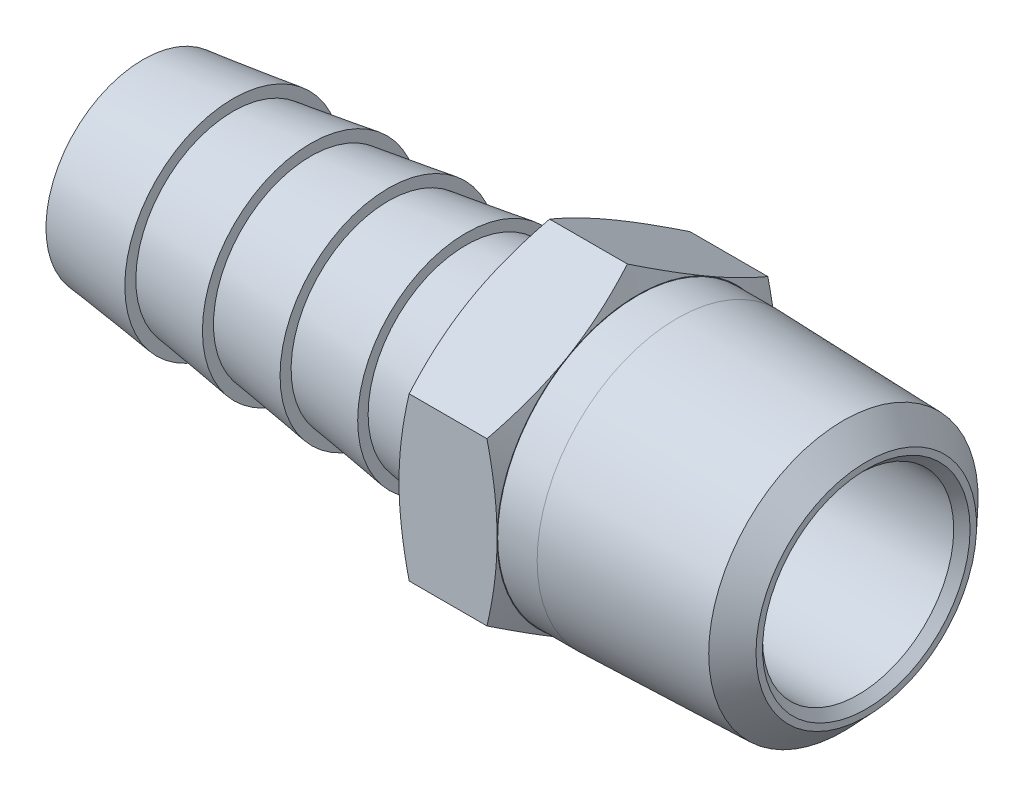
ISO-10303-21;
HEADER;
FILE_DESCRIPTION(('STEP AP214'),'2;1');
FILE_NAME('part.step','',(''),(''),'','','');
FILE_SCHEMA(('AUTOMOTIVE_DESIGN { 1 0 10303 214 1 1 1 1 }'));
ENDSEC;
DATA;
#1=APPLICATION_CONTEXT('core data for automotive mechanical design processes');
#2=APPLICATION_PROTOCOL_DEFINITION('international standard','automotive_design',2000,#1);
#3=PRODUCT_CONTEXT('',#1,'mechanical');
#4=PRODUCT('Part','Part','',(#3));
#5=PRODUCT_RELATED_PRODUCT_CATEGORY('part','',(#4));
#6=PRODUCT_DEFINITION_FORMATION('','',#4);
#7=PRODUCT_DEFINITION_CONTEXT('part definition',#1,'design');
#8=PRODUCT_DEFINITION('design','',#6,#7);
#9=PRODUCT_DEFINITION_SHAPE('','',#8);
#10=(LENGTH_UNIT() NAMED_UNIT(*) SI_UNIT(.MILLI.,.METRE.));
#11=(NAMED_UNIT(*) PLANE_ANGLE_UNIT() SI_UNIT($,.RADIAN.));
#12=(NAMED_UNIT(*) SI_UNIT($,.STERADIAN.) SOLID_ANGLE_UNIT());
#13=UNCERTAINTY_MEASURE_WITH_UNIT(LENGTH_MEASURE(1.E-05),#10,'distance_accuracy_value','');
#14=(GEOMETRIC_REPRESENTATION_CONTEXT(3) GLOBAL_UNCERTAINTY_ASSIGNED_CONTEXT((#13)) GLOBAL_UNIT_ASSIGNED_CONTEXT((#10,
#11,#12)) REPRESENTATION_CONTEXT('',''));
#15=CARTESIAN_POINT('',(0.,0.,0.));
#16=DIRECTION('',(0.,0.,1.));
#17=DIRECTION('',(1.,0.,0.));
#18=AXIS2_PLACEMENT_3D('',#15,#16,#17);
#19=CARTESIAN_POINT('',(24.638,0.,0.));
#20=DIRECTION('',(1.,0.,0.));
#21=DIRECTION('',(0.,0.,-1.));
#22=AXIS2_PLACEMENT_3D('',#19,#20,#21);
#23=PLANE('',#22);
#24=CARTESIAN_POINT('',(24.6380000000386,0.,0.));
#25=DIRECTION('',(1.,0.,0.));
#26=DIRECTION('',(0.,0.,-1.));
#27=AXIS2_PLACEMENT_3D('',#24,#25,#26);
#28=CIRCLE('',#27,6.73099999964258);
#29=CARTESIAN_POINT('',(24.6380000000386,0.,-6.73099999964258));
#30=VERTEX_POINT('',#29);
#31=EDGE_CURVE('E110',#30,#30,#28,.F.);
#32=ORIENTED_EDGE('',*,*,#31,.F.);
#33=EDGE_LOOP('',(#32));
#34=FACE_BOUND('',#33,.T.);
#35=CARTESIAN_POINT('',(24.6379999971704,0.,0.));
#36=DIRECTION('',(1.,0.,0.));
#37=DIRECTION('',(0.,1.,0.));
#38=AXIS2_PLACEMENT_3D('',#35,#36,#37);
#39=CIRCLE('',#38,8.73125000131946);
#40=CARTESIAN_POINT('',(24.6379999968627,-7.56148430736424,4.36562500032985));
#41=VERTEX_POINT('',#40);
#42=CARTESIAN_POINT('',(24.6379999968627,-7.56148430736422,-4.36562500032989));
#43=VERTEX_POINT('',#42);
#44=EDGE_CURVE('E111',#41,#43,#39,.T.);
#45=ORIENTED_EDGE('',*,*,#44,.F.);
#46=CARTESIAN_POINT('',(24.6379999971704,0.,0.));
#47=DIRECTION('',(1.,0.,0.));
#48=DIRECTION('',(0.,1.,0.));
#49=AXIS2_PLACEMENT_3D('',#46,#47,#48);
#50=CIRCLE('',#49,8.73125000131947);
#51=CARTESIAN_POINT('',(24.6379999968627,0.,8.73125000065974));
#52=VERTEX_POINT('',#51);
#53=EDGE_CURVE('E529',#52,#41,#50,.T.);
#54=ORIENTED_EDGE('',*,*,#53,.F.);
#55=CARTESIAN_POINT('',(24.6379999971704,0.,0.));
#56=DIRECTION('',(1.,0.,0.));
#57=DIRECTION('',(0.,1.,0.));
#58=AXIS2_PLACEMENT_3D('',#55,#56,#57);
#59=CIRCLE('',#58,8.73125000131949);
#60=CARTESIAN_POINT('',(24.6379999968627,7.56148430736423,4.36562500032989));
#61=VERTEX_POINT('',#60);
#62=EDGE_CURVE('E531',#61,#52,#59,.T.);
#63=ORIENTED_EDGE('',*,*,#62,.F.);
#64=CARTESIAN_POINT('',(24.6379999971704,0.,0.));
#65=DIRECTION('',(1.,0.,0.));
#66=DIRECTION('',(0.,1.,0.));
#67=AXIS2_PLACEMENT_3D('',#64,#65,#66);
#68=CIRCLE('',#67,8.73125000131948);
#69=CARTESIAN_POINT('',(24.6379999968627,7.56148430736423,-4.36562500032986));
#70=VERTEX_POINT('',#69);
#71=EDGE_CURVE('E124',#70,#61,#68,.T.);
#72=ORIENTED_EDGE('',*,*,#71,.F.);
#73=CARTESIAN_POINT('',(24.6379999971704,0.,0.));
#74=DIRECTION('',(1.,0.,0.));
#75=DIRECTION('',(0.,1.,0.));
#76=AXIS2_PLACEMENT_3D('',#73,#74,#75);
#77=CIRCLE('',#76,8.73125000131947);
#78=CARTESIAN_POINT('',(24.6379999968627,0.,-8.73125000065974));
#79=VERTEX_POINT('',#78);
#80=EDGE_CURVE('E18',#79,#70,#77,.T.);
#81=ORIENTED_EDGE('',*,*,#80,.F.);
#82=CARTESIAN_POINT('',(24.6379999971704,0.,0.));
#83=DIRECTION('',(1.,0.,0.));
#84=DIRECTION('',(0.,1.,0.));
#85=AXIS2_PLACEMENT_3D('',#82,#83,#84);
#86=CIRCLE('',#85,8.73125000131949);
#87=EDGE_CURVE('E101',#43,#79,#86,.T.);
#88=ORIENTED_EDGE('',*,*,#87,.F.);
#89=EDGE_LOOP('',(#45,#54,#63,#72,#81,#88));
#90=FACE_BOUND('',#89,.T.);
#91=ADVANCED_FACE('F14',(#34,#90),#23,.F.);
#92=CARTESIAN_POINT('',(25.2716344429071,0.,0.));
#93=DIRECTION('',(1.,0.,0.));
#94=DIRECTION('',(0.,1.,0.));
#95=AXIS2_PLACEMENT_3D('',#92,#93,#94);
#96=CONICAL_SURFACE('',#95,10.0900834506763,1.1344640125);
#97=CARTESIAN_POINT('',(24.6379999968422,0.,-8.73124999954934));
#98=CARTESIAN_POINT('',(24.6379747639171,0.21260870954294,-8.73124999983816));
#99=CARTESIAN_POINT('',(24.6416206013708,0.425211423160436,-8.73124999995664));
#100=CARTESIAN_POINT('',(24.6560676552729,0.850150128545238,-8.73125000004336));
#101=CARTESIAN_POINT('',(24.6668680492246,1.0624861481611,-8.73125000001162));
#102=CARTESIAN_POINT('',(24.6953900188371,1.4859802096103,-8.73124999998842));
#103=CARTESIAN_POINT('',(24.7130884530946,1.69713982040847,-8.73124999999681));
#104=CARTESIAN_POINT('',(24.7550637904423,2.11880198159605,-8.73125000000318));
#105=CARTESIAN_POINT('',(24.7793407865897,2.32930452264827,-8.73125000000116));
#106=CARTESIAN_POINT('',(24.8613831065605,2.95925193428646,-8.73124999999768));
#107=CARTESIAN_POINT('',(24.9283852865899,3.37749625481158,-8.73124999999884));
#108=CARTESIAN_POINT('',(25.0833534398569,4.21157495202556,-8.73125000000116));
#109=CARTESIAN_POINT('',(25.1713893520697,4.62739644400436,-8.73125000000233));
#110=CARTESIAN_POINT('',(25.2678553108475,5.04098953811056,-8.73125));
#111=B_SPLINE_CURVE_WITH_KNOTS('',3,(#97,#98,#99,#100,#101,#102,#103,#104,#105,#106,#107,#108,
#109,#110),.UNSPECIFIED.,.F.,.F.,(4,2,2,2,2,2,4),(0.,0.637785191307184,1.27549707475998,
1.9110877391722,2.54668739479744,3.81680689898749,5.0912099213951),.UNSPECIFIED.);
#112=CARTESIAN_POINT('',(25.2678553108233,5.04098953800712,-8.73125));
#113=VERTEX_POINT('',#112);
#114=EDGE_CURVE('E116',#79,#113,#111,.T.);
#115=ORIENTED_EDGE('',*,*,#114,.F.);
#116=ORIENTED_EDGE('',*,*,#80,.T.);
#117=CARTESIAN_POINT('',(25.2678553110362,5.04098953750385,-8.73125000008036));
#118=CARTESIAN_POINT('',(25.1713893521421,5.24778608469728,-8.37306787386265));
#119=CARTESIAN_POINT('',(25.0833534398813,5.45569683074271,-8.01295589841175));
#120=CARTESIAN_POINT('',(24.9283852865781,5.87273617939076,-7.29062255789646));
#121=CARTESIAN_POINT('',(24.8613831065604,6.08185833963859,-6.92841235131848));
#122=CARTESIAN_POINT('',(24.7793407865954,6.39683204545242,-6.38286188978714));
#123=CARTESIAN_POINT('',(24.7550637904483,6.50208331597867,-6.2005613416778));
#124=CARTESIAN_POINT('',(24.7130884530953,6.71291439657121,-5.8353911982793));
#125=CARTESIAN_POINT('',(24.6953900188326,6.81849420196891,-5.65252161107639));
#126=CARTESIAN_POINT('',(24.6668680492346,7.03024123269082,-5.28576499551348));
#127=CARTESIAN_POINT('',(24.6560676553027,7.13640924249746,-5.1018766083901));
#128=CARTESIAN_POINT('',(24.6416206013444,7.34887859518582,-4.73386889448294));
#129=CARTESIAN_POINT('',(24.6379747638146,7.45517995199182,-4.54974954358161));
#130=CARTESIAN_POINT('',(24.6379999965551,7.56148430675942,-4.36562500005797));
#131=B_SPLINE_CURVE_WITH_KNOTS('',3,(#117,#118,#119,#120,#121,#122,#123,#124,#125,#126,#127,
#128,#129,#130),.UNSPECIFIED.,.F.,.F.,(4,2,2,2,2,2,4),(0.,1.27440302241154,2.54452252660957,
3.18012218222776,3.81571284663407,4.45342473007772,5.09120992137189),.UNSPECIFIED.);
#132=EDGE_CURVE('E130',#113,#70,#131,.T.);
#133=ORIENTED_EDGE('',*,*,#132,.F.);
#134=EDGE_LOOP('',(#115,#116,#133));
#135=FACE_BOUND('',#134,.T.);
#136=ADVANCED_FACE('F129',(#135),#96,.T.);
#137=CARTESIAN_POINT('',(25.2716344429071,0.,0.));
#138=DIRECTION('',(1.,0.,0.));
#139=DIRECTION('',(0.,1.,0.));
#140=AXIS2_PLACEMENT_3D('',#137,#138,#139);
#141=CONICAL_SURFACE('',#140,10.0900834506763,1.1344640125);
#142=CARTESIAN_POINT('',(24.6379999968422,7.5614843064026,-4.36562499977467));
#143=CARTESIAN_POINT('',(24.6379747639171,7.66778866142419,-4.18150045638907));
#144=CARTESIAN_POINT('',(24.6416206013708,7.77409001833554,-3.99738110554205));
#145=CARTESIAN_POINT('',(24.6560676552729,7.98655937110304,-3.6293733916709));
#146=CARTESIAN_POINT('',(24.6668680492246,8.09272738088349,-3.44548500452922));
#147=CARTESIAN_POINT('',(24.6953900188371,8.304474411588,-3.07872838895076));
#148=CARTESIAN_POINT('',(24.7130884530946,8.41005421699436,-2.89585880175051));
#149=CARTESIAN_POINT('',(24.7550637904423,8.62088529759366,-2.5306886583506));
#150=CARTESIAN_POINT('',(24.7793407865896,8.72613656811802,-2.34838811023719));
#151=CARTESIAN_POINT('',(24.8613831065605,9.0411102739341,-1.80283764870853));
#152=CARTESIAN_POINT('',(24.9283852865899,9.25023243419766,-1.44062744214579));
#153=CARTESIAN_POINT('',(25.0833534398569,9.66727178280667,-0.718294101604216));
#154=CARTESIAN_POINT('',(25.1713893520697,9.87518252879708,-0.35818212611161));
#155=CARTESIAN_POINT('',(25.2678553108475,10.0819790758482,2.15330518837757E-10));
#156=B_SPLINE_CURVE_WITH_KNOTS('',3,(#142,#143,#144,#145,#146,#147,#148,#149,#150,#151,#152,
#153,#154,#155),.UNSPECIFIED.,.F.,.F.,(4,2,2,2,2,2,4),(0.,0.637785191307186,1.27549707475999,
1.91108773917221,2.54668739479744,3.8168068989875,5.09120992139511),.UNSPECIFIED.);
#157=CARTESIAN_POINT('',(25.2678553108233,10.0819790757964,1.25751281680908E-10));
#158=VERTEX_POINT('',#157);
#159=EDGE_CURVE('E493',#70,#158,#156,.T.);
#160=ORIENTED_EDGE('',*,*,#159,.F.);
#161=ORIENTED_EDGE('',*,*,#71,.T.);
#162=CARTESIAN_POINT('',(25.2678553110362,10.0819790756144,-3.5028064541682E-10));
#163=CARTESIAN_POINT('',(25.1713893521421,9.87518252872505,0.358182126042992));
#164=CARTESIAN_POINT('',(25.0833534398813,9.6672717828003,0.718294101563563));
#165=CARTESIAN_POINT('',(24.9283852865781,9.25023243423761,1.44062744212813));
#166=CARTESIAN_POINT('',(24.8613831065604,9.04111027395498,1.80283764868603));
#167=CARTESIAN_POINT('',(24.7793407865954,8.72613656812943,2.3483881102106));
#168=CARTESIAN_POINT('',(24.7550637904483,8.62088529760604,2.5306886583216));
#169=CARTESIAN_POINT('',(24.7130884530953,8.4100542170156,2.89585880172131));
#170=CARTESIAN_POINT('',(24.6953900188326,8.30447441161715,3.07872838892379));
#171=CARTESIAN_POINT('',(24.6668680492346,8.09272738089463,3.44548500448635));
#172=CARTESIAN_POINT('',(24.6560676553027,7.98655937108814,3.62937339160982));
#173=CARTESIAN_POINT('',(24.6416206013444,7.77409001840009,3.99738110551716));
#174=CARTESIAN_POINT('',(24.6379747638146,7.66778866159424,4.18150045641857));
#175=CARTESIAN_POINT('',(24.6379999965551,7.56148430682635,4.36562499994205));
#176=B_SPLINE_CURVE_WITH_KNOTS('',3,(#162,#163,#164,#165,#166,#167,#168,#169,#170,#171,#172,
#173,#174,#175),.UNSPECIFIED.,.F.,.F.,(4,2,2,2,2,2,4),(0.,1.27440302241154,2.54452252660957,
3.18012218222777,3.81571284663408,4.45342473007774,5.09120992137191),.UNSPECIFIED.);
#177=EDGE_CURVE('E332',#158,#61,#176,.T.);
#178=ORIENTED_EDGE('',*,*,#177,.F.);
#179=EDGE_LOOP('',(#160,#161,#178));
#180=FACE_BOUND('',#179,.T.);
#181=ADVANCED_FACE('F156',(#180),#141,.T.);
#182=CARTESIAN_POINT('',(25.2716344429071,0.,0.));
#183=DIRECTION('',(1.,0.,0.));
#184=DIRECTION('',(0.,1.,0.));
#185=AXIS2_PLACEMENT_3D('',#182,#183,#184);
#186=CONICAL_SURFACE('',#185,10.0900834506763,1.1344640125);
#187=CARTESIAN_POINT('',(24.6379999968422,7.5614843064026,4.36562499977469));
#188=CARTESIAN_POINT('',(24.6379747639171,7.45517995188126,4.5497495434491));
#189=CARTESIAN_POINT('',(24.6416206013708,7.34887859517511,4.7338688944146));
#190=CARTESIAN_POINT('',(24.6560676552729,7.13640924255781,5.10187660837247));
#191=CARTESIAN_POINT('',(24.6668680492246,7.03024123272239,5.2857649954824));
#192=CARTESIAN_POINT('',(24.6953900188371,6.8184942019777,5.65252161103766));
#193=CARTESIAN_POINT('',(24.7130884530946,6.71291439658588,5.83539119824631));
#194=CARTESIAN_POINT('',(24.7550637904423,6.50208331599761,6.20056134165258));
#195=CARTESIAN_POINT('',(24.7793407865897,6.39683204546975,6.38286188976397));
#196=CARTESIAN_POINT('',(24.8613831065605,6.08185833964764,6.92841235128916));
#197=CARTESIAN_POINT('',(24.9283852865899,5.87273617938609,7.29062255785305));
#198=CARTESIAN_POINT('',(25.0833534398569,5.45569683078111,8.01295589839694));
#199=CARTESIAN_POINT('',(25.1713893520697,5.24778608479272,8.37306787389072));
#200=CARTESIAN_POINT('',(25.2678553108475,5.04098953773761,8.73125000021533));
#201=B_SPLINE_CURVE_WITH_KNOTS('',3,(#187,#188,#189,#190,#191,#192,#193,#194,#195,#196,#197,
#198,#199,#200),.UNSPECIFIED.,.F.,.F.,(4,2,2,2,2,2,4),(0.,0.637785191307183,1.27549707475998,
1.9110877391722,2.54668739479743,3.81680689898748,5.09120992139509),.UNSPECIFIED.);
#202=CARTESIAN_POINT('',(25.2678553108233,5.04098953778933,8.73125000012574));
#203=VERTEX_POINT('',#202);
#204=EDGE_CURVE('E327',#61,#203,#201,.T.);
#205=ORIENTED_EDGE('',*,*,#204,.F.);
#206=ORIENTED_EDGE('',*,*,#62,.T.);
#207=CARTESIAN_POINT('',(25.2678553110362,5.04098953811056,8.73124999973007));
#208=CARTESIAN_POINT('',(25.1713893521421,4.62739644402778,8.73124999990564));
#209=CARTESIAN_POINT('',(25.0833534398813,4.21157495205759,8.73124999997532));
#210=CARTESIAN_POINT('',(24.9283852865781,3.37749625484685,8.7312500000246));
#211=CARTESIAN_POINT('',(24.8613831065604,2.9592519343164,8.73125000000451));
#212=CARTESIAN_POINT('',(24.7793407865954,2.32930452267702,8.73124999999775));
#213=CARTESIAN_POINT('',(24.7550637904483,2.11880198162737,8.73124999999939));
#214=CARTESIAN_POINT('',(24.7130884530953,1.6971398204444,8.73125000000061));
#215=CARTESIAN_POINT('',(24.6953900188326,1.48598020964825,8.73125000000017));
#216=CARTESIAN_POINT('',(24.6668680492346,1.06248614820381,8.73124999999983));
#217=CARTESIAN_POINT('',(24.6560676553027,0.850150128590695,8.73124999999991));
#218=CARTESIAN_POINT('',(24.6416206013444,0.425211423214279,8.73125000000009));
#219=CARTESIAN_POINT('',(24.6379747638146,0.21260870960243,8.73125000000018));
#220=CARTESIAN_POINT('',(24.6379999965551,6.69401972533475E-11,8.73125));
#221=B_SPLINE_CURVE_WITH_KNOTS('',3,(#207,#208,#209,#210,#211,#212,#213,#214,#215,#216,#217,
#218,#219,#220),.UNSPECIFIED.,.F.,.F.,(4,2,2,2,2,2,4),(0.,1.27440302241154,2.54452252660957,
3.18012218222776,3.81571284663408,4.45342473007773,5.0912099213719),.UNSPECIFIED.);
#222=EDGE_CURVE('E320',#203,#52,#221,.T.);
#223=ORIENTED_EDGE('',*,*,#222,.F.);
#224=EDGE_LOOP('',(#205,#206,#223));
#225=FACE_BOUND('',#224,.T.);
#226=ADVANCED_FACE('F310',(#225),#186,.T.);
#227=CARTESIAN_POINT('',(25.2716344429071,0.,0.));
#228=DIRECTION('',(1.,0.,0.));
#229=DIRECTION('',(0.,1.,0.));
#230=AXIS2_PLACEMENT_3D('',#227,#228,#229);
#231=CONICAL_SURFACE('',#230,10.0900834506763,1.1344640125);
#232=ORIENTED_EDGE('',*,*,#53,.T.);
#233=CARTESIAN_POINT('',(25.2678553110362,-5.04098953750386,8.73125000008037));
#234=CARTESIAN_POINT('',(25.1713893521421,-5.24778608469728,8.37306787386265));
#235=CARTESIAN_POINT('',(25.0833534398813,-5.45569683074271,8.01295589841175));
#236=CARTESIAN_POINT('',(24.9283852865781,-5.87273617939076,7.29062255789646));
#237=CARTESIAN_POINT('',(24.8613831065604,-6.08185833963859,6.92841235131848));
#238=CARTESIAN_POINT('',(24.7793407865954,-6.39683204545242,6.38286188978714));
#239=CARTESIAN_POINT('',(24.7550637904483,-6.50208331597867,6.20056134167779));
#240=CARTESIAN_POINT('',(24.7130884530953,-6.71291439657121,5.83539119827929));
#241=CARTESIAN_POINT('',(24.6953900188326,-6.81849420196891,5.65252161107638));
#242=CARTESIAN_POINT('',(24.6668680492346,-7.03024123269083,5.28576499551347));
#243=CARTESIAN_POINT('',(24.6560676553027,-7.13640924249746,5.10187660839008));
#244=CARTESIAN_POINT('',(24.6416206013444,-7.34887859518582,4.73386889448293));
#245=CARTESIAN_POINT('',(24.6379747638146,-7.45517995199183,4.5497495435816));
#246=CARTESIAN_POINT('',(24.6379999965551,-7.56148430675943,4.36562500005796));
#247=B_SPLINE_CURVE_WITH_KNOTS('',3,(#233,#234,#235,#236,#237,#238,#239,#240,#241,#242,#243,
#244,#245,#246),.UNSPECIFIED.,.F.,.F.,(4,2,2,2,2,2,4),(0.,1.27440302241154,2.54452252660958,
3.18012218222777,3.81571284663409,4.45342473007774,5.09120992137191),.UNSPECIFIED.);
#248=CARTESIAN_POINT('',(25.2678553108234,-5.04098953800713,8.73125));
#249=VERTEX_POINT('',#248);
#250=EDGE_CURVE('E290',#249,#41,#247,.T.);
#251=ORIENTED_EDGE('',*,*,#250,.F.);
#252=CARTESIAN_POINT('',(24.6379999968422,0.,8.73124999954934));
#253=CARTESIAN_POINT('',(24.6379747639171,-0.212608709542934,8.73124999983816));
#254=CARTESIAN_POINT('',(24.6416206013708,-0.425211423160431,8.73124999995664));
#255=CARTESIAN_POINT('',(24.6560676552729,-0.850150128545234,8.73125000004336));
#256=CARTESIAN_POINT('',(24.6668680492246,-1.06248614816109,8.73125000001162));
#257=CARTESIAN_POINT('',(24.6953900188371,-1.4859802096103,8.73124999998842));
#258=CARTESIAN_POINT('',(24.7130884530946,-1.69713982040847,8.73124999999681));
#259=CARTESIAN_POINT('',(24.7550637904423,-2.11880198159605,8.73125000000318));
#260=CARTESIAN_POINT('',(24.7793407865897,-2.32930452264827,8.73125000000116));
#261=CARTESIAN_POINT('',(24.8613831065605,-2.95925193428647,8.73124999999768));
#262=CARTESIAN_POINT('',(24.9283852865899,-3.37749625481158,8.73124999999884));
#263=CARTESIAN_POINT('',(25.0833534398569,-4.21157495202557,8.73125000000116));
#264=CARTESIAN_POINT('',(25.1713893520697,-4.62739644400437,8.73125000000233));
#265=CARTESIAN_POINT('',(25.2678553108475,-5.04098953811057,8.73125));
#266=B_SPLINE_CURVE_WITH_KNOTS('',3,(#252,#253,#254,#255,#256,#257,#258,#259,#260,#261,#262,
#263,#264,#265),.UNSPECIFIED.,.F.,.F.,(4,2,2,2,2,2,4),(0.,0.637785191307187,1.27549707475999,
1.91108773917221,2.54668739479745,3.8168068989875,5.09120992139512),.UNSPECIFIED.);
#267=EDGE_CURVE('E314',#52,#249,#266,.T.);
#268=ORIENTED_EDGE('',*,*,#267,.F.);
#269=EDGE_LOOP('',(#232,#251,#268));
#270=FACE_BOUND('',#269,.T.);
#271=ADVANCED_FACE('F304',(#270),#231,.T.);
#272=CARTESIAN_POINT('',(25.2716344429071,0.,0.));
#273=DIRECTION('',(1.,0.,0.));
#274=DIRECTION('',(0.,1.,0.));
#275=AXIS2_PLACEMENT_3D('',#272,#273,#274);
#276=CONICAL_SURFACE('',#275,10.0900834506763,1.1344640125);
#277=ORIENTED_EDGE('',*,*,#44,.T.);
#278=CARTESIAN_POINT('',(25.2678553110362,-10.0819790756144,3.5027144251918E-10));
#279=CARTESIAN_POINT('',(25.1713893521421,-9.87518252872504,-0.358182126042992));
#280=CARTESIAN_POINT('',(25.0833534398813,-9.66727178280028,-0.718294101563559));
#281=CARTESIAN_POINT('',(24.9283852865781,-9.25023243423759,-1.44062744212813));
#282=CARTESIAN_POINT('',(24.8613831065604,-9.04111027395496,-1.80283764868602));
#283=CARTESIAN_POINT('',(24.7793407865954,-8.72613656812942,-2.34838811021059));
#284=CARTESIAN_POINT('',(24.7550637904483,-8.62088529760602,-2.53068865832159));
#285=CARTESIAN_POINT('',(24.7130884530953,-8.41005421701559,-2.8958588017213));
#286=CARTESIAN_POINT('',(24.6953900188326,-8.30447441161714,-3.07872838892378));
#287=CARTESIAN_POINT('',(24.6668680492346,-8.09272738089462,-3.44548500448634));
#288=CARTESIAN_POINT('',(24.6560676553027,-7.98655937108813,-3.62937339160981));
#289=CARTESIAN_POINT('',(24.6416206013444,-7.77409001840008,-3.99738110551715));
#290=CARTESIAN_POINT('',(24.6379747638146,-7.66778866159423,-4.18150045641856));
#291=CARTESIAN_POINT('',(24.6379999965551,-7.56148430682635,-4.36562499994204));
#292=B_SPLINE_CURVE_WITH_KNOTS('',3,(#278,#279,#280,#281,#282,#283,#284,#285,#286,#287,#288,
#289,#290,#291),.UNSPECIFIED.,.F.,.F.,(4,2,2,2,2,2,4),(0.,1.27440302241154,2.54452252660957,
3.18012218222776,3.81571284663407,4.45342473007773,5.0912099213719),.UNSPECIFIED.);
#293=CARTESIAN_POINT('',(25.2678553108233,-10.0819790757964,-1.2576087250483E-10));
#294=VERTEX_POINT('',#293);
#295=EDGE_CURVE('E291',#294,#43,#292,.T.);
#296=ORIENTED_EDGE('',*,*,#295,.F.);
#297=CARTESIAN_POINT('',(24.6379999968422,-7.56148430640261,4.36562499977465));
#298=CARTESIAN_POINT('',(24.6379747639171,-7.6677886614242,4.18150045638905));
#299=CARTESIAN_POINT('',(24.6416206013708,-7.77409001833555,3.99738110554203));
#300=CARTESIAN_POINT('',(24.6560676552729,-7.98655937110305,3.62937339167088));
#301=CARTESIAN_POINT('',(24.6668680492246,-8.09272738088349,3.44548500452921));
#302=CARTESIAN_POINT('',(24.6953900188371,-8.304474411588,3.07872838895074));
#303=CARTESIAN_POINT('',(24.7130884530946,-8.41005421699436,2.89585880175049));
#304=CARTESIAN_POINT('',(24.7550637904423,-8.62088529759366,2.53068865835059));
#305=CARTESIAN_POINT('',(24.7793407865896,-8.72613656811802,2.34838811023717));
#306=CARTESIAN_POINT('',(24.8613831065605,-9.04111027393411,1.80283764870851));
#307=CARTESIAN_POINT('',(24.9283852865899,-9.25023243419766,1.44062744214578));
#308=CARTESIAN_POINT('',(25.0833534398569,-9.66727178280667,0.718294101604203));
#309=CARTESIAN_POINT('',(25.1713893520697,-9.87518252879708,0.358182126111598));
#310=CARTESIAN_POINT('',(25.2678553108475,-10.0819790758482,-2.1534150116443E-10));
#311=B_SPLINE_CURVE_WITH_KNOTS('',3,(#297,#298,#299,#300,#301,#302,#303,#304,#305,#306,#307,
#308,#309,#310),.UNSPECIFIED.,.F.,.F.,(4,2,2,2,2,2,4),(0.,0.637785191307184,1.27549707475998,
1.9110877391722,2.54668739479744,3.81680689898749,5.0912099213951),.UNSPECIFIED.);
#312=EDGE_CURVE('E283',#41,#294,#311,.T.);
#313=ORIENTED_EDGE('',*,*,#312,.F.);
#314=EDGE_LOOP('',(#277,#296,#313));
#315=FACE_BOUND('',#314,.T.);
#316=ADVANCED_FACE('F301',(#315),#276,.T.);
#317=CARTESIAN_POINT('',(25.2716344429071,0.,0.));
#318=DIRECTION('',(1.,0.,0.));
#319=DIRECTION('',(0.,1.,0.));
#320=AXIS2_PLACEMENT_3D('',#317,#318,#319);
#321=CONICAL_SURFACE('',#320,10.0900834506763,1.1344640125);
#322=ORIENTED_EDGE('',*,*,#87,.T.);
#323=CARTESIAN_POINT('',(25.2678553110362,-5.04098953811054,-8.73124999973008));
#324=CARTESIAN_POINT('',(25.1713893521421,-4.62739644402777,-8.73124999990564));
#325=CARTESIAN_POINT('',(25.0833534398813,-4.21157495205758,-8.73124999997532));
#326=CARTESIAN_POINT('',(24.9283852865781,-3.37749625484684,-8.7312500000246));
#327=CARTESIAN_POINT('',(24.8613831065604,-2.95925193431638,-8.73125000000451));
#328=CARTESIAN_POINT('',(24.7793407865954,-2.329304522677,-8.73124999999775));
#329=CARTESIAN_POINT('',(24.7550637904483,-2.11880198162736,-8.73124999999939));
#330=CARTESIAN_POINT('',(24.7130884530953,-1.69713982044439,-8.73125000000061));
#331=CARTESIAN_POINT('',(24.6953900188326,-1.48598020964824,-8.73125000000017));
#332=CARTESIAN_POINT('',(24.6668680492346,-1.0624861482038,-8.73124999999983));
#333=CARTESIAN_POINT('',(24.6560676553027,-0.850150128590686,-8.73124999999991));
#334=CARTESIAN_POINT('',(24.6416206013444,-0.425211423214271,-8.73125000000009));
#335=CARTESIAN_POINT('',(24.6379747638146,-0.212608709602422,-8.73125000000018));
#336=CARTESIAN_POINT('',(24.6379999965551,-6.69327607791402E-11,-8.73125));
#337=B_SPLINE_CURVE_WITH_KNOTS('',3,(#323,#324,#325,#326,#327,#328,#329,#330,#331,#332,#333,
#334,#335,#336),.UNSPECIFIED.,.F.,.F.,(4,2,2,2,2,2,4),(0.,1.27440302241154,2.54452252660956,
3.18012218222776,3.81571284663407,4.45342473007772,5.09120992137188),.UNSPECIFIED.);
#338=CARTESIAN_POINT('',(25.2678553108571,-5.0409895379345,-8.73125000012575));
#339=VERTEX_POINT('',#338);
#340=EDGE_CURVE('E104',#339,#79,#337,.T.);
#341=ORIENTED_EDGE('',*,*,#340,.F.);
#342=CARTESIAN_POINT('',(24.6379999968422,-7.56148430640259,-4.36562499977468));
#343=CARTESIAN_POINT('',(24.6379747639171,-7.45517995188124,-4.5497495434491));
#344=CARTESIAN_POINT('',(24.6416206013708,-7.34887859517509,-4.73386889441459));
#345=CARTESIAN_POINT('',(24.6560676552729,-7.13640924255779,-5.10187660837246));
#346=CARTESIAN_POINT('',(24.6668680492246,-7.03024123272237,-5.2857649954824));
#347=CARTESIAN_POINT('',(24.6953900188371,-6.81849420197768,-5.65252161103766));
#348=CARTESIAN_POINT('',(24.7130884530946,-6.71291439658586,-5.83539119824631));
#349=CARTESIAN_POINT('',(24.7550637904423,-6.50208331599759,-6.20056134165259));
#350=CARTESIAN_POINT('',(24.7793407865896,-6.39683204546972,-6.38286188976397));
#351=CARTESIAN_POINT('',(24.8613831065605,-6.08185833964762,-6.92841235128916));
#352=CARTESIAN_POINT('',(24.9283852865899,-5.87273617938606,-7.29062255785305));
#353=CARTESIAN_POINT('',(25.0833534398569,-5.45569683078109,-8.01295589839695));
#354=CARTESIAN_POINT('',(25.1713893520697,-5.2477860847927,-8.37306787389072));
#355=CARTESIAN_POINT('',(25.2678553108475,-5.04098953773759,-8.73125000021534));
#356=B_SPLINE_CURVE_WITH_KNOTS('',3,(#342,#343,#344,#345,#346,#347,#348,#349,#350,#351,#352,
#353,#354,#355),.UNSPECIFIED.,.F.,.F.,(4,2,2,2,2,2,4),(0.,0.637785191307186,1.27549707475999,
1.91108773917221,2.54668739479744,3.8168068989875,5.09120992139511),.UNSPECIFIED.);
#357=EDGE_CURVE('E106',#43,#339,#356,.T.);
#358=ORIENTED_EDGE('',*,*,#357,.F.);
#359=EDGE_LOOP('',(#322,#341,#358));
#360=FACE_BOUND('',#359,.T.);
#361=ADVANCED_FACE('F103',(#360),#321,.T.);
#362=CARTESIAN_POINT('',(24.6379999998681,0.,0.));
#363=DIRECTION('',(1.,0.,0.));
#364=DIRECTION('',(0.,0.,-1.));
#365=AXIS2_PLACEMENT_3D('',#362,#363,#364);
#366=CONICAL_SURFACE('',#365,6.73099999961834,0.141160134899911);
#367=ORIENTED_EDGE('',*,*,#31,.T.);
#368=EDGE_LOOP('',(#367));
#369=FACE_BOUND('',#368,.T.);
#370=CARTESIAN_POINT('',(20.0659999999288,0.,0.));
#371=DIRECTION('',(1.,0.,0.));
#372=DIRECTION('',(0.,0.,-1.));
#373=AXIS2_PLACEMENT_3D('',#370,#371,#372);
#374=CIRCLE('',#373,6.08129473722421);
#375=CARTESIAN_POINT('',(20.0659999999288,0.,-6.08129473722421));
#376=VERTEX_POINT('',#375);
#377=EDGE_CURVE('E433',#376,#376,#374,.F.);
#378=ORIENTED_EDGE('',*,*,#377,.F.);
#379=EDGE_LOOP('',(#378));
#380=FACE_BOUND('',#379,.T.);
#381=ADVANCED_FACE('F698',(#369,#380),#366,.T.);
#382=CARTESIAN_POINT('',(24.638,5.04098953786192,-8.73125));
#383=DIRECTION('',(0.,0.,-1.));
#384=DIRECTION('',(-1.,0.,0.));
#385=AXIS2_PLACEMENT_3D('',#382,#383,#384);
#386=PLANE('',#385);
#387=ORIENTED_EDGE('',*,*,#114,.T.);
#388=DIRECTION('',(1.,0.,0.));
#389=VECTOR('',#388,1.);
#390=CARTESIAN_POINT('',(24.638,5.04098953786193,-8.73125));
#391=LINE('',#390,#389);
#392=CARTESIAN_POINT('',(30.1041446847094,5.04098955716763,-8.73125));
#393=VERTEX_POINT('',#392);
#394=EDGE_CURVE('E131',#393,#113,#391,.F.);
#395=ORIENTED_EDGE('',*,*,#394,.F.);
#396=CARTESIAN_POINT('',(30.7340000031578,0.,-8.73124999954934));
#397=CARTESIAN_POINT('',(30.7340252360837,0.212608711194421,-8.73124999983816));
#398=CARTESIAN_POINT('',(30.730379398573,0.425211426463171,-8.73124999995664));
#399=CARTESIAN_POINT('',(30.715932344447,0.85015013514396,-8.73125000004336));
#400=CARTESIAN_POINT('',(30.7051319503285,1.06248615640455,-8.73125000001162));
#401=CARTESIAN_POINT('',(30.6766099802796,1.48598022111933,-8.73124999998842));
#402=CARTESIAN_POINT('',(30.6589115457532,1.6971398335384,-8.73124999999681));
#403=CARTESIAN_POINT('',(30.6169362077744,2.11880199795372,-8.73125000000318));
#404=CARTESIAN_POINT('',(30.5926592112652,2.3293045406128,-8.73125000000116));
#405=CARTESIAN_POINT('',(30.5106168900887,2.95925195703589,-8.73124999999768));
#406=CARTESIAN_POINT('',(30.4436147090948,3.37749628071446,-8.73124999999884));
#407=CARTESIAN_POINT('',(30.288646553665,4.2115749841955,-8.73125000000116));
#408=CARTESIAN_POINT('',(30.2006106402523,4.62739647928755,-8.73125000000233));
#409=CARTESIAN_POINT('',(30.1041446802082,5.04098957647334,-8.73125));
#410=B_SPLINE_CURVE_WITH_KNOTS('',3,(#396,#397,#398,#399,#400,#401,#402,#403,#404,#405,#406,
#407,#408,#409),.UNSPECIFIED.,.F.,.F.,(4,2,2,2,2,2,4),(0.,0.637785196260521,1.27549708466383,
1.91108775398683,2.54668741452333,3.81680692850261,5.09120996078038),.UNSPECIFIED.);
#411=CARTESIAN_POINT('',(30.7340000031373,0.,-8.73125000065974));
#412=VERTEX_POINT('',#411);
#413=EDGE_CURVE('E390',#412,#393,#410,.T.);
#414=ORIENTED_EDGE('',*,*,#413,.F.);
#415=CARTESIAN_POINT('',(30.1041447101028,-5.04098944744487,-8.73124999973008));
#416=CARTESIAN_POINT('',(30.2006106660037,-4.62739636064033,-8.73124999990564));
#417=CARTESIAN_POINT('',(30.288646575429,-4.2115748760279,-8.73124999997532));
#418=CARTESIAN_POINT('',(30.4436147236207,-3.37749619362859,-8.7312500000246));
#419=CARTESIAN_POINT('',(30.5106169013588,-2.95925188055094,-8.73125000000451));
#420=CARTESIAN_POINT('',(30.5926592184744,-2.32930448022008,-8.73124999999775));
#421=CARTESIAN_POINT('',(30.6169362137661,-2.11880194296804,-8.73124999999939));
#422=CARTESIAN_POINT('',(30.6589115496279,-1.69713978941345,-8.73125000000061));
#423=CARTESIAN_POINT('',(30.6766099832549,-1.48598018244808,-8.73125000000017));
#424=CARTESIAN_POINT('',(30.7051319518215,-1.06248612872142,-8.73124999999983));
#425=CARTESIAN_POINT('',(30.7159323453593,-0.850150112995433,-8.73124999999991));
#426=CARTESIAN_POINT('',(30.7303793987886,-0.425211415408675,-8.73125000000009));
#427=CARTESIAN_POINT('',(30.7340252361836,-0.212608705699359,-8.73125000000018));
#428=CARTESIAN_POINT('',(30.7340000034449,-6.69292053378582E-11,-8.73125));
#429=B_SPLINE_CURVE_WITH_KNOTS('',3,(#415,#416,#417,#418,#419,#420,#421,#422,#423,#424,#425,
#426,#427,#428),.UNSPECIFIED.,.F.,.F.,(4,2,2,2,2,2,4),(0.,1.27440299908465,2.54452248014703,
3.18012212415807,3.81571277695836,4.45342464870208,5.09120982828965),.UNSPECIFIED.);
#430=CARTESIAN_POINT('',(30.1041446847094,-5.04098952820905,-8.73125001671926));
#431=VERTEX_POINT('',#430);
#432=EDGE_CURVE('E412',#431,#412,#429,.T.);
#433=ORIENTED_EDGE('',*,*,#432,.F.);
#434=DIRECTION('',(1.,0.,0.));
#435=VECTOR('',#434,1.);
#436=CARTESIAN_POINT('',(24.638,-5.0409895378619,-8.73125));
#437=LINE('',#436,#435);
#438=EDGE_CURVE('E119',#339,#431,#437,.T.);
#439=ORIENTED_EDGE('',*,*,#438,.F.);
#440=ORIENTED_EDGE('',*,*,#340,.T.);
#441=EDGE_LOOP('',(#387,#395,#414,#433,#439,#440));
#442=FACE_BOUND('',#441,.T.);
#443=ADVANCED_FACE('F114',(#442),#386,.T.);
#444=CARTESIAN_POINT('',(24.638,10.0819790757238,0.));
#445=DIRECTION('',(0.,0.866025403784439,-0.5));
#446=DIRECTION('',(0.,0.5,0.866025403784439));
#447=AXIS2_PLACEMENT_3D('',#444,#445,#446);
#448=PLANE('',#447);
#449=ORIENTED_EDGE('',*,*,#159,.T.);
#450=DIRECTION('',(1.,0.,0.));
#451=VECTOR('',#450,1.);
#452=CARTESIAN_POINT('',(24.638,10.0819790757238,0.));
#453=LINE('',#452,#451);
#454=CARTESIAN_POINT('',(30.1041446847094,10.0819790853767,1.67192426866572E-08));
#455=VERTEX_POINT('',#454);
#456=EDGE_CURVE('E490',#455,#158,#453,.F.);
#457=ORIENTED_EDGE('',*,*,#456,.F.);
#458=CARTESIAN_POINT('',(30.7340000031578,7.5614843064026,-4.36562499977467));
#459=CARTESIAN_POINT('',(30.7340252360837,7.66778866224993,-4.18150045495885));
#460=CARTESIAN_POINT('',(30.730379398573,7.77409001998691,-3.9973811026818));
#461=CARTESIAN_POINT('',(30.7159323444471,7.9865593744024,-3.62937338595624));
#462=CARTESIAN_POINT('',(30.7051319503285,8.09272738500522,-3.44548499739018));
#463=CARTESIAN_POINT('',(30.6766099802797,8.30447441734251,-3.07872837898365));
#464=CARTESIAN_POINT('',(30.6589115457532,8.41005422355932,-2.89585879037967));
#465=CARTESIAN_POINT('',(30.6169362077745,8.6208853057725,-2.53068864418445));
#466=CARTESIAN_POINT('',(30.5926592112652,8.72613657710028,-2.34838809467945));
#467=CARTESIAN_POINT('',(30.5106168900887,9.04111028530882,-1.80283762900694));
#468=CARTESIAN_POINT('',(30.4436147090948,9.2502324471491,-1.44062741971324));
#469=CARTESIAN_POINT('',(30.288646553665,9.66727179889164,-0.718294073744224));
#470=CARTESIAN_POINT('',(30.2006106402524,9.87518254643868,-0.358182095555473));
#471=CARTESIAN_POINT('',(30.1041446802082,10.0819790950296,3.34384731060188E-08));
#472=B_SPLINE_CURVE_WITH_KNOTS('',3,(#458,#459,#460,#461,#462,#463,#464,#465,#466,#467,#468,
#469,#470,#471),.UNSPECIFIED.,.F.,.F.,(4,2,2,2,2,2,4),(0.,0.637785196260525,1.27549708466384,
1.91108775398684,2.54668741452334,3.81680692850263,5.0912099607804),.UNSPECIFIED.);
#473=CARTESIAN_POINT('',(30.7340000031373,7.56148430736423,-4.36562500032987));
#474=VERTEX_POINT('',#473);
#475=EDGE_CURVE('E382',#474,#455,#472,.T.);
#476=ORIENTED_EDGE('',*,*,#475,.F.);
#477=CARTESIAN_POINT('',(30.1041447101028,5.04098958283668,-8.73124992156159));
#478=CARTESIAN_POINT('',(30.2006106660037,5.24778612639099,-8.37306780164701));
#479=CARTESIAN_POINT('',(30.288646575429,5.45569686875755,-8.01295583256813));
#480=CARTESIAN_POINT('',(30.4436147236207,5.87273620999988,-7.29062250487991));
#481=CARTESIAN_POINT('',(30.5106169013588,6.08185836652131,-6.92841230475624));
#482=CARTESIAN_POINT('',(30.5926592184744,6.39683206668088,-6.38286185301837));
#483=CARTESIAN_POINT('',(30.6169362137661,6.50208333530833,-6.20056130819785));
#484=CARTESIAN_POINT('',(30.6589115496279,6.71291441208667,-5.83539117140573));
#485=CARTESIAN_POINT('',(30.6766099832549,6.81849421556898,-5.65252158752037));
#486=CARTESIAN_POINT('',(30.7051319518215,7.03024124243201,-5.28576497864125));
#487=CARTESIAN_POINT('',(30.7159323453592,7.13640925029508,-5.10187659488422));
#488=CARTESIAN_POINT('',(30.7303793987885,7.34887859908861,-4.7338688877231));
#489=CARTESIAN_POINT('',(30.7340252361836,7.45517995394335,-4.54974954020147));
#490=CARTESIAN_POINT('',(30.7340000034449,7.56148430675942,-4.36562500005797));
#491=B_SPLINE_CURVE_WITH_KNOTS('',3,(#477,#478,#479,#480,#481,#482,#483,#484,#485,#486,#487,
#488,#489,#490),.UNSPECIFIED.,.F.,.F.,(4,2,2,2,2,2,4),(0.,1.27440299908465,2.54452248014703,
3.18012212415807,3.81571277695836,4.45342464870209,5.09120982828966),.UNSPECIFIED.);
#492=EDGE_CURVE('E393',#393,#474,#491,.T.);
#493=ORIENTED_EDGE('',*,*,#492,.F.);
#494=ORIENTED_EDGE('',*,*,#394,.T.);
#495=ORIENTED_EDGE('',*,*,#132,.T.);
#496=EDGE_LOOP('',(#449,#457,#476,#493,#494,#495));
#497=FACE_BOUND('',#496,.T.);
#498=ADVANCED_FACE('F339',(#497),#448,.T.);
#499=CARTESIAN_POINT('',(24.638,5.04098953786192,8.73125));
#500=DIRECTION('',(0.,0.866025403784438,0.5));
#501=DIRECTION('',(0.,-0.5,0.866025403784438));
#502=AXIS2_PLACEMENT_3D('',#499,#500,#501);
#503=PLANE('',#502);
#504=ORIENTED_EDGE('',*,*,#204,.T.);
#505=DIRECTION('',(1.,0.,0.));
#506=VECTOR('',#505,1.);
#507=CARTESIAN_POINT('',(24.638,5.04098953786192,8.73125));
#508=LINE('',#507,#506);
#509=CARTESIAN_POINT('',(30.1041446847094,5.04098952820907,8.73125001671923));
#510=VERTEX_POINT('',#509);
#511=EDGE_CURVE('E326',#510,#203,#508,.F.);
#512=ORIENTED_EDGE('',*,*,#511,.F.);
#513=CARTESIAN_POINT('',(30.7340000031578,7.56148430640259,4.36562499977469));
#514=CARTESIAN_POINT('',(30.7340252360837,7.45517995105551,4.54974954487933));
#515=CARTESIAN_POINT('',(30.730379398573,7.34887859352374,4.73386889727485));
#516=CARTESIAN_POINT('',(30.715932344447,7.13640923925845,5.10187661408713));
#517=CARTESIAN_POINT('',(30.7051319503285,7.03024122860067,5.28576500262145));
#518=CARTESIAN_POINT('',(30.6766099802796,6.81849419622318,5.65252162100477));
#519=CARTESIAN_POINT('',(30.6589115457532,6.71291439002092,5.83539120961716));
#520=CARTESIAN_POINT('',(30.6169362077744,6.50208330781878,6.20056135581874));
#521=CARTESIAN_POINT('',(30.5926592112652,6.39683203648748,6.38286190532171));
#522=CARTESIAN_POINT('',(30.5106168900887,6.08185832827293,6.92841237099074));
#523=CARTESIAN_POINT('',(30.4436147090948,5.87273616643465,7.2906225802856));
#524=CARTESIAN_POINT('',(30.288646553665,5.45569681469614,8.01295592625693));
#525=CARTESIAN_POINT('',(30.2006106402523,5.24778606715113,8.37306790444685));
#526=CARTESIAN_POINT('',(30.1041446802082,5.04098951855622,8.73125003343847));
#527=B_SPLINE_CURVE_WITH_KNOTS('',3,(#513,#514,#515,#516,#517,#518,#519,#520,#521,#522,#523,
#524,#525,#526),.UNSPECIFIED.,.F.,.F.,(4,2,2,2,2,2,4),(0.,0.637785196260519,1.27549708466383,
1.91108775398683,2.54668741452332,3.8168069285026,5.09120996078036),.UNSPECIFIED.);
#528=CARTESIAN_POINT('',(30.7340000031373,7.56148430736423,4.36562500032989));
#529=VERTEX_POINT('',#528);
#530=EDGE_CURVE('E354',#529,#510,#527,.T.);
#531=ORIENTED_EDGE('',*,*,#530,.F.);
#532=CARTESIAN_POINT('',(30.1041447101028,10.0819790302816,7.81684926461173E-08));
#533=CARTESIAN_POINT('',(30.2006106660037,9.87518248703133,0.358182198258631));
#534=CARTESIAN_POINT('',(30.288646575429,9.66727174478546,0.718294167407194));
#535=CARTESIAN_POINT('',(30.4436147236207,9.25023240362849,1.44062749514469));
#536=CARTESIAN_POINT('',(30.5106169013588,9.04111024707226,1.80283769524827));
#537=CARTESIAN_POINT('',(30.5926592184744,8.72613654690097,2.34838814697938));
#538=CARTESIAN_POINT('',(30.6169362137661,8.62088527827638,2.53068869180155));
#539=CARTESIAN_POINT('',(30.6589115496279,8.41005420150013,2.89585882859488));
#540=CARTESIAN_POINT('',(30.6766099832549,8.30447439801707,3.07872841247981));
#541=CARTESIAN_POINT('',(30.7051319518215,8.09272737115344,3.44548502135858));
#542=CARTESIAN_POINT('',(30.7159323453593,7.98655936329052,3.6293734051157));
#543=CARTESIAN_POINT('',(30.7303793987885,7.77409001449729,3.997381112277));
#544=CARTESIAN_POINT('',(30.7340252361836,7.66778865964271,4.18150045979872));
#545=CARTESIAN_POINT('',(30.7340000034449,7.56148430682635,4.36562499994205));
#546=B_SPLINE_CURVE_WITH_KNOTS('',3,(#532,#533,#534,#535,#536,#537,#538,#539,#540,#541,#542,
#543,#544,#545),.UNSPECIFIED.,.F.,.F.,(4,2,2,2,2,2,4),(0.,1.27440299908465,2.54452248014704,
3.18012212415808,3.81571277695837,4.4534246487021,5.09120982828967),.UNSPECIFIED.);
#547=EDGE_CURVE('E345',#455,#529,#546,.T.);
#548=ORIENTED_EDGE('',*,*,#547,.F.);
#549=ORIENTED_EDGE('',*,*,#456,.T.);
#550=ORIENTED_EDGE('',*,*,#177,.T.);
#551=EDGE_LOOP('',(#504,#512,#531,#548,#549,#550));
#552=FACE_BOUND('',#551,.T.);
#553=ADVANCED_FACE('F336',(#552),#503,.T.);
#554=CARTESIAN_POINT('',(24.638,-5.04098953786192,8.73125));
#555=DIRECTION('',(0.,0.,1.));
#556=DIRECTION('',(1.,0.,0.));
#557=AXIS2_PLACEMENT_3D('',#554,#555,#556);
#558=PLANE('',#557);
#559=DIRECTION('',(1.,0.,0.));
#560=VECTOR('',#559,1.);
#561=CARTESIAN_POINT('',(24.638,-5.04098953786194,8.73125));
#562=LINE('',#561,#560);
#563=CARTESIAN_POINT('',(30.1041446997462,-5.04098949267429,8.73125));
#564=VERTEX_POINT('',#563);
#565=EDGE_CURVE('E319',#564,#249,#562,.F.);
#566=ORIENTED_EDGE('',*,*,#565,.F.);
#567=CARTESIAN_POINT('',(30.7340000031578,0.,8.73124999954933));
#568=CARTESIAN_POINT('',(30.7340252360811,-0.212608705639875,8.73124999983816));
#569=CARTESIAN_POINT('',(30.7303793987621,-0.425211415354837,8.73124999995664));
#570=CARTESIAN_POINT('',(30.715932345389,-0.850150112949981,8.73125000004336));
#571=CARTESIAN_POINT('',(30.7051319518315,-1.06248612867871,8.73125000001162));
#572=CARTESIAN_POINT('',(30.6766099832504,-1.48598018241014,8.73124999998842));
#573=CARTESIAN_POINT('',(30.6589115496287,-1.69713978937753,8.73124999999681));
#574=CARTESIAN_POINT('',(30.616936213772,-2.11880194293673,8.73125000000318));
#575=CARTESIAN_POINT('',(30.5926592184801,-2.32930448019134,8.73125000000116));
#576=CARTESIAN_POINT('',(30.5106169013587,-2.95925188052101,8.73124999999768));
#577=CARTESIAN_POINT('',(30.4436147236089,-3.37749619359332,8.73124999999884));
#578=CARTESIAN_POINT('',(30.2886465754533,-4.21157487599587,8.73125000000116));
#579=CARTESIAN_POINT('',(30.2006106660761,-4.62739636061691,8.73125000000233));
#580=CARTESIAN_POINT('',(30.1041447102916,-5.04098944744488,8.73125));
#581=B_SPLINE_CURVE_WITH_KNOTS('',3,(#567,#568,#569,#570,#571,#572,#573,#574,#575,#576,#577,
#578,#579,#580),.UNSPECIFIED.,.F.,.F.,(4,2,2,2,2,2,4),(0.,0.637785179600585,1.27549705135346,
1.91108770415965,2.54668734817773,3.81680682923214,5.09120982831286),.UNSPECIFIED.);
#582=CARTESIAN_POINT('',(30.7340000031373,0.,8.73125000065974));
#583=VERTEX_POINT('',#582);
#584=EDGE_CURVE('E360',#583,#564,#581,.T.);
#585=ORIENTED_EDGE('',*,*,#584,.F.);
#586=CARTESIAN_POINT('',(30.1041447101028,5.04098944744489,8.73124999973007));
#587=CARTESIAN_POINT('',(30.2006106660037,4.62739636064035,8.73124999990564));
#588=CARTESIAN_POINT('',(30.288646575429,4.21157487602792,8.73124999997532));
#589=CARTESIAN_POINT('',(30.4436147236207,3.37749619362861,8.7312500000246));
#590=CARTESIAN_POINT('',(30.5106169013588,2.95925188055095,8.73125000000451));
#591=CARTESIAN_POINT('',(30.5926592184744,2.32930448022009,8.73124999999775));
#592=CARTESIAN_POINT('',(30.6169362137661,2.11880194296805,8.73124999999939));
#593=CARTESIAN_POINT('',(30.6589115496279,1.69713978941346,8.73125000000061));
#594=CARTESIAN_POINT('',(30.6766099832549,1.48598018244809,8.73125000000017));
#595=CARTESIAN_POINT('',(30.7051319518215,1.06248612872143,8.73124999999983));
#596=CARTESIAN_POINT('',(30.7159323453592,0.850150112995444,8.73124999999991));
#597=CARTESIAN_POINT('',(30.7303793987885,0.425211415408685,8.73125000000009));
#598=CARTESIAN_POINT('',(30.7340252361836,0.212608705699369,8.73125000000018));
#599=CARTESIAN_POINT('',(30.7340000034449,6.69381753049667E-11,8.73125));
#600=B_SPLINE_CURVE_WITH_KNOTS('',3,(#586,#587,#588,#589,#590,#591,#592,#593,#594,#595,#596,
#597,#598,#599),.UNSPECIFIED.,.F.,.F.,(4,2,2,2,2,2,4),(0.,1.27440299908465,2.54452248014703,
3.18012212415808,3.81571277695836,4.45342464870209,5.09120982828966),.UNSPECIFIED.);
#601=EDGE_CURVE('E361',#510,#583,#600,.T.);
#602=ORIENTED_EDGE('',*,*,#601,.F.);
#603=ORIENTED_EDGE('',*,*,#511,.T.);
#604=ORIENTED_EDGE('',*,*,#222,.T.);
#605=ORIENTED_EDGE('',*,*,#267,.T.);
#606=EDGE_LOOP('',(#566,#585,#602,#603,#604,#605));
#607=FACE_BOUND('',#606,.T.);
#608=ADVANCED_FACE('F272',(#607),#558,.T.);
#609=CARTESIAN_POINT('',(24.638,-10.0819790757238,0.));
#610=DIRECTION('',(0.,-0.86602540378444,0.5));
#611=DIRECTION('',(0.,-0.5,-0.86602540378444));
#612=AXIS2_PLACEMENT_3D('',#609,#610,#611);
#613=PLANE('',#612);
#614=DIRECTION('',(1.,0.,0.));
#615=VECTOR('',#614,1.);
#616=CARTESIAN_POINT('',(24.638,-10.0819790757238,0.));
#617=LINE('',#616,#615);
#618=CARTESIAN_POINT('',(30.1041446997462,-10.08197905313,3.91336309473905E-08));
#619=VERTEX_POINT('',#618);
#620=EDGE_CURVE('E289',#619,#294,#617,.F.);
#621=ORIENTED_EDGE('',*,*,#620,.F.);
#622=CARTESIAN_POINT('',(30.7340000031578,-7.56148430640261,4.36562499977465));
#623=CARTESIAN_POINT('',(30.7340252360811,-7.66778865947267,4.1815004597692));
#624=CARTESIAN_POINT('',(30.7303793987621,-7.77409001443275,3.99738111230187));
#625=CARTESIAN_POINT('',(30.715932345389,-7.98655936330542,3.62937340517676));
#626=CARTESIAN_POINT('',(30.7051319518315,-8.0927273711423,3.44548502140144));
#627=CARTESIAN_POINT('',(30.6766099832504,-8.30447439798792,3.07872841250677));
#628=CARTESIAN_POINT('',(30.6589115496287,-8.41005420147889,2.89585882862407));
#629=CARTESIAN_POINT('',(30.6169362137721,-8.620885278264,2.53068869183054));
#630=CARTESIAN_POINT('',(30.5926592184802,-8.72613654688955,2.34838814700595));
#631=CARTESIAN_POINT('',(30.5106169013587,-9.04111024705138,1.80283769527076));
#632=CARTESIAN_POINT('',(30.4436147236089,-9.25023240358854,1.44062749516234));
#633=CARTESIAN_POINT('',(30.2886465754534,-9.66727174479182,0.718294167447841));
#634=CARTESIAN_POINT('',(30.2006106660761,-9.87518248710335,0.358182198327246));
#635=CARTESIAN_POINT('',(30.1041447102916,-10.0819790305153,7.83034402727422E-08));
#636=B_SPLINE_CURVE_WITH_KNOTS('',3,(#622,#623,#624,#625,#626,#627,#628,#629,#630,#631,#632,
#633,#634,#635),.UNSPECIFIED.,.F.,.F.,(4,2,2,2,2,2,4),(0.,0.637785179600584,1.27549705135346,
1.91108770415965,2.54668734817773,3.81680682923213,5.09120982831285),.UNSPECIFIED.);
#637=CARTESIAN_POINT('',(30.7340000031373,-7.56148430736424,4.36562500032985));
#638=VERTEX_POINT('',#637);
#639=EDGE_CURVE('E256',#638,#619,#636,.T.);
#640=ORIENTED_EDGE('',*,*,#639,.F.);
#641=CARTESIAN_POINT('',(30.1041446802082,-5.04098951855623,8.73125003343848));
#642=CARTESIAN_POINT('',(30.20061064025,-5.24778606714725,8.3730679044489));
#643=CARTESIAN_POINT('',(30.2886465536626,-5.45569681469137,8.01295592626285));
#644=CARTESIAN_POINT('',(30.4436147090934,-5.87273616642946,7.29062258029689));
#645=CARTESIAN_POINT('',(30.5106168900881,-6.08185832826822,6.92841237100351));
#646=CARTESIAN_POINT('',(30.5926592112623,-6.39683203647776,6.38286190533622));
#647=CARTESIAN_POINT('',(30.6169362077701,-6.50208330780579,6.20056135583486));
#648=CARTESIAN_POINT('',(30.6589115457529,-6.71291439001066,5.83539120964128));
#649=CARTESIAN_POINT('',(30.6766099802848,-6.81849419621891,5.65252162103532));
#650=CARTESIAN_POINT('',(30.7051319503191,-7.03024122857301,5.28576500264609));
#651=CARTESIAN_POINT('',(30.7159323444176,-7.13640923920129,5.1018766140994));
#652=CARTESIAN_POINT('',(30.7303793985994,-7.34887859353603,4.73386889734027));
#653=CARTESIAN_POINT('',(30.7340252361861,-7.45517995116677,4.54974954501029));
#654=CARTESIAN_POINT('',(30.7340000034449,-7.56148430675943,4.36562500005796));
#655=B_SPLINE_CURVE_WITH_KNOTS('',3,(#641,#642,#643,#644,#645,#646,#647,#648,#649,#650,#651,
#652,#653,#654),.UNSPECIFIED.,.F.,.F.,(4,2,2,2,2,2,4),(0.,1.27440303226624,2.54452254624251,
3.1801222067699,3.81571287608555,4.45342476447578,5.09120996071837),.UNSPECIFIED.);
#656=EDGE_CURVE('E33',#564,#638,#655,.T.);
#657=ORIENTED_EDGE('',*,*,#656,.F.);
#658=ORIENTED_EDGE('',*,*,#565,.T.);
#659=ORIENTED_EDGE('',*,*,#250,.T.);
#660=ORIENTED_EDGE('',*,*,#312,.T.);
#661=EDGE_LOOP('',(#621,#640,#657,#658,#659,#660));
#662=FACE_BOUND('',#661,.T.);
#663=ADVANCED_FACE('F267',(#662),#613,.T.);
#664=CARTESIAN_POINT('',(24.638,-5.0409895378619,-8.73125));
#665=DIRECTION('',(0.,-0.866025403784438,-0.5));
#666=DIRECTION('',(0.,0.5,-0.866025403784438));
#667=AXIS2_PLACEMENT_3D('',#664,#665,#666);
#668=PLANE('',#667);
#669=ORIENTED_EDGE('',*,*,#438,.T.);
#670=CARTESIAN_POINT('',(30.7340000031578,-7.56148430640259,-4.36562499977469));
#671=CARTESIAN_POINT('',(30.7340252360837,-7.4551799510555,-4.54974954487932));
#672=CARTESIAN_POINT('',(30.730379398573,-7.34887859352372,-4.73386889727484));
#673=CARTESIAN_POINT('',(30.7159323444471,-7.13640923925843,-5.10187661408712));
#674=CARTESIAN_POINT('',(30.7051319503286,-7.03024122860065,-5.28576500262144));
#675=CARTESIAN_POINT('',(30.6766099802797,-6.81849419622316,-5.65252162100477));
#676=CARTESIAN_POINT('',(30.6589115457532,-6.7129143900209,-5.83539120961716));
#677=CARTESIAN_POINT('',(30.6169362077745,-6.50208330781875,-6.20056135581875));
#678=CARTESIAN_POINT('',(30.5926592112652,-6.39683203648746,-6.38286190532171));
#679=CARTESIAN_POINT('',(30.5106168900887,-6.0818583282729,-6.92841237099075));
#680=CARTESIAN_POINT('',(30.4436147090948,-5.87273616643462,-7.29062258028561));
#681=CARTESIAN_POINT('',(30.288646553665,-5.45569681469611,-8.01295592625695));
#682=CARTESIAN_POINT('',(30.2006106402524,-5.2477860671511,-8.37306790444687));
#683=CARTESIAN_POINT('',(30.1041446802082,-5.04098951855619,-8.73125003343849));
#684=B_SPLINE_CURVE_WITH_KNOTS('',3,(#670,#671,#672,#673,#674,#675,#676,#677,#678,#679,#680,
#681,#682,#683),.UNSPECIFIED.,.F.,.F.,(4,2,2,2,2,2,4),(0.,0.637785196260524,1.27549708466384,
1.91108775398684,2.54668741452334,3.81680692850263,5.0912099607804),.UNSPECIFIED.);
#685=CARTESIAN_POINT('',(30.7340000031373,-7.56148430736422,-4.36562500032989));
#686=VERTEX_POINT('',#685);
#687=EDGE_CURVE('E398',#686,#431,#684,.T.);
#688=ORIENTED_EDGE('',*,*,#687,.F.);
#689=CARTESIAN_POINT('',(30.1041446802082,-10.0819790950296,3.3438455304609E-08));
#690=CARTESIAN_POINT('',(30.20061064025,-9.8751825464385,-0.358182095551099));
#691=CARTESIAN_POINT('',(30.2886465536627,-9.66727179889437,-0.718294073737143));
#692=CARTESIAN_POINT('',(30.4436147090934,-9.25023244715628,-1.4406274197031));
#693=CARTESIAN_POINT('',(30.5106168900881,-9.04111028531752,-1.80283762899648));
#694=CARTESIAN_POINT('',(30.5926592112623,-8.72613657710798,-2.34838809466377));
#695=CARTESIAN_POINT('',(30.6169362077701,-8.62088530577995,-2.53068864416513));
#696=CARTESIAN_POINT('',(30.6589115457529,-8.41005422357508,-2.89585879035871));
#697=CARTESIAN_POINT('',(30.6766099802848,-8.30447441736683,-3.07872837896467));
#698=CARTESIAN_POINT('',(30.7051319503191,-8.09272738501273,-3.4454849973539));
#699=CARTESIAN_POINT('',(30.7159323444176,-7.98655937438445,-3.62937338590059));
#700=CARTESIAN_POINT('',(30.7303793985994,-7.77409002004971,-3.99738110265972));
#701=CARTESIAN_POINT('',(30.7340252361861,-7.66778866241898,-4.18150045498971));
#702=CARTESIAN_POINT('',(30.7340000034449,-7.56148430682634,-4.36562499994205));
#703=B_SPLINE_CURVE_WITH_KNOTS('',3,(#689,#690,#691,#692,#693,#694,#695,#696,#697,#698,#699,
#700,#701,#702),.UNSPECIFIED.,.F.,.F.,(4,2,2,2,2,2,4),(0.,1.27440303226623,2.54452254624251,
3.1801222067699,3.81571287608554,4.45342476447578,5.09120996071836),.UNSPECIFIED.);
#704=EDGE_CURVE('E249',#619,#686,#703,.T.);
#705=ORIENTED_EDGE('',*,*,#704,.F.);
#706=ORIENTED_EDGE('',*,*,#620,.T.);
#707=ORIENTED_EDGE('',*,*,#295,.T.);
#708=ORIENTED_EDGE('',*,*,#357,.T.);
#709=EDGE_LOOP('',(#669,#688,#705,#706,#707,#708));
#710=FACE_BOUND('',#709,.T.);
#711=ADVANCED_FACE('F271',(#710),#668,.T.);
#712=CARTESIAN_POINT('',(20.066,6.40614736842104,0.));
#713=DIRECTION('',(1.,0.,0.));
#714=DIRECTION('',(0.,0.,-1.));
#715=AXIS2_PLACEMENT_3D('',#712,#713,#714);
#716=PLANE('',#715);
#717=ORIENTED_EDGE('',*,*,#377,.T.);
#718=EDGE_LOOP('',(#717));
#719=FACE_BOUND('',#718,.T.);
#720=CARTESIAN_POINT('',(20.0660000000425,0.,0.));
#721=DIRECTION('',(1.,0.,0.));
#722=DIRECTION('',(0.,1.,0.));
#723=AXIS2_PLACEMENT_3D('',#720,#721,#722);
#724=CIRCLE('',#723,6.73099999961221);
#725=CARTESIAN_POINT('',(20.0660000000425,6.73099999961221,0.));
#726=VERTEX_POINT('',#725);
#727=EDGE_CURVE('E436',#726,#726,#724,.F.);
#728=ORIENTED_EDGE('',*,*,#727,.F.);
#729=EDGE_LOOP('',(#728));
#730=FACE_BOUND('',#729,.T.);
#731=ADVANCED_FACE('F420',(#719,#730),#716,.T.);
#732=CARTESIAN_POINT('',(30.1003655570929,0.,0.));
#733=DIRECTION('',(-1.,0.,0.));
#734=DIRECTION('',(0.,0.,1.));
#735=AXIS2_PLACEMENT_3D('',#732,#733,#734);
#736=CONICAL_SURFACE('',#735,10.0900834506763,1.1344640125);
#737=CARTESIAN_POINT('',(30.7340000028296,0.,0.));
#738=DIRECTION('',(-1.,0.,0.));
#739=DIRECTION('',(0.,0.,1.));
#740=AXIS2_PLACEMENT_3D('',#737,#738,#739);
#741=CIRCLE('',#740,8.73125000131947);
#742=EDGE_CURVE('E437',#686,#412,#741,.F.);
#743=ORIENTED_EDGE('',*,*,#742,.F.);
#744=ORIENTED_EDGE('',*,*,#687,.T.);
#745=ORIENTED_EDGE('',*,*,#432,.T.);
#746=EDGE_LOOP('',(#743,#744,#745));
#747=FACE_BOUND('',#746,.T.);
#748=ADVANCED_FACE('F417',(#747),#736,.T.);
#749=CARTESIAN_POINT('',(30.1003655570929,0.,0.));
#750=DIRECTION('',(-1.,0.,0.));
#751=DIRECTION('',(0.,0.,1.));
#752=AXIS2_PLACEMENT_3D('',#749,#750,#751);
#753=CONICAL_SURFACE('',#752,10.0900834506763,1.1344640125);
#754=CARTESIAN_POINT('',(30.7340000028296,0.,0.));
#755=DIRECTION('',(-1.,0.,0.));
#756=DIRECTION('',(0.,0.,1.));
#757=AXIS2_PLACEMENT_3D('',#754,#755,#756);
#758=CIRCLE('',#757,8.73125000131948);
#759=EDGE_CURVE('E439',#412,#474,#758,.F.);
#760=ORIENTED_EDGE('',*,*,#759,.F.);
#761=ORIENTED_EDGE('',*,*,#413,.T.);
#762=ORIENTED_EDGE('',*,*,#492,.T.);
#763=EDGE_LOOP('',(#760,#761,#762));
#764=FACE_BOUND('',#763,.T.);
#765=ADVANCED_FACE('F377',(#764),#753,.T.);
#766=CARTESIAN_POINT('',(30.1003655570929,0.,0.));
#767=DIRECTION('',(-1.,0.,0.));
#768=DIRECTION('',(0.,0.,1.));
#769=AXIS2_PLACEMENT_3D('',#766,#767,#768);
#770=CONICAL_SURFACE('',#769,10.0900834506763,1.1344640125);
#771=CARTESIAN_POINT('',(30.7340000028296,0.,0.));
#772=DIRECTION('',(-1.,0.,0.));
#773=DIRECTION('',(0.,0.,1.));
#774=AXIS2_PLACEMENT_3D('',#771,#772,#773);
#775=CIRCLE('',#774,8.73125000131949);
#776=EDGE_CURVE('E444',#474,#529,#775,.F.);
#777=ORIENTED_EDGE('',*,*,#776,.F.);
#778=ORIENTED_EDGE('',*,*,#475,.T.);
#779=ORIENTED_EDGE('',*,*,#547,.T.);
#780=EDGE_LOOP('',(#777,#778,#779));
#781=FACE_BOUND('',#780,.T.);
#782=ADVANCED_FACE('F371',(#781),#770,.T.);
#783=CARTESIAN_POINT('',(30.1003655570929,0.,0.));
#784=DIRECTION('',(-1.,0.,0.));
#785=DIRECTION('',(0.,0.,1.));
#786=AXIS2_PLACEMENT_3D('',#783,#784,#785);
#787=CONICAL_SURFACE('',#786,10.0900834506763,1.1344640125);
#788=CARTESIAN_POINT('',(30.7340000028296,0.,0.));
#789=DIRECTION('',(-1.,0.,0.));
#790=DIRECTION('',(0.,0.,1.));
#791=AXIS2_PLACEMENT_3D('',#788,#789,#790);
#792=CIRCLE('',#791,8.73125000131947);
#793=EDGE_CURVE('E446',#529,#583,#792,.F.);
#794=ORIENTED_EDGE('',*,*,#793,.F.);
#795=ORIENTED_EDGE('',*,*,#530,.T.);
#796=ORIENTED_EDGE('',*,*,#601,.T.);
#797=EDGE_LOOP('',(#794,#795,#796));
#798=FACE_BOUND('',#797,.T.);
#799=ADVANCED_FACE('F368',(#798),#787,.T.);
#800=CARTESIAN_POINT('',(30.1003655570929,0.,0.));
#801=DIRECTION('',(-1.,0.,0.));
#802=DIRECTION('',(0.,0.,1.));
#803=AXIS2_PLACEMENT_3D('',#800,#801,#802);
#804=CONICAL_SURFACE('',#803,10.0900834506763,1.1344640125);
#805=ORIENTED_EDGE('',*,*,#656,.T.);
#806=CARTESIAN_POINT('',(30.7340000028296,0.,0.));
#807=DIRECTION('',(-1.,0.,0.));
#808=DIRECTION('',(0.,0.,1.));
#809=AXIS2_PLACEMENT_3D('',#806,#807,#808);
#810=CIRCLE('',#809,8.73125000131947);
#811=EDGE_CURVE('E449',#583,#638,#810,.F.);
#812=ORIENTED_EDGE('',*,*,#811,.F.);
#813=ORIENTED_EDGE('',*,*,#584,.T.);
#814=EDGE_LOOP('',(#805,#812,#813));
#815=FACE_BOUND('',#814,.T.);
#816=ADVANCED_FACE('F243',(#815),#804,.T.);
#817=CARTESIAN_POINT('',(30.1003655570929,0.,0.));
#818=DIRECTION('',(-1.,0.,0.));
#819=DIRECTION('',(0.,0.,1.));
#820=AXIS2_PLACEMENT_3D('',#817,#818,#819);
#821=CONICAL_SURFACE('',#820,10.0900834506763,1.1344640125);
#822=ORIENTED_EDGE('',*,*,#704,.T.);
#823=CARTESIAN_POINT('',(30.7340000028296,0.,0.));
#824=DIRECTION('',(-1.,0.,0.));
#825=DIRECTION('',(0.,0.,1.));
#826=AXIS2_PLACEMENT_3D('',#823,#824,#825);
#827=CIRCLE('',#826,8.73125000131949);
#828=EDGE_CURVE('E451',#638,#686,#827,.F.);
#829=ORIENTED_EDGE('',*,*,#828,.F.);
#830=ORIENTED_EDGE('',*,*,#639,.T.);
#831=EDGE_LOOP('',(#822,#829,#830));
#832=FACE_BOUND('',#831,.T.);
#833=ADVANCED_FACE('F238',(#832),#821,.T.);
#834=CARTESIAN_POINT('',(20.0659999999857,0.,0.));
#835=DIRECTION('',(1.,0.,0.));
#836=DIRECTION('',(0.,1.,0.));
#837=AXIS2_PLACEMENT_3D('',#834,#835,#836);
#838=CONICAL_SURFACE('',#837,6.73099999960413,0.141160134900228);
#839=ORIENTED_EDGE('',*,*,#727,.T.);
#840=EDGE_LOOP('',(#839));
#841=FACE_BOUND('',#840,.T.);
#842=CARTESIAN_POINT('',(15.2399999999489,0.,0.));
#843=DIRECTION('',(1.,0.,0.));
#844=DIRECTION('',(0.,1.,0.));
#845=AXIS2_PLACEMENT_3D('',#842,#843,#844);
#846=CIRCLE('',#845,6.04520000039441);
#847=CARTESIAN_POINT('',(15.2399999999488,6.04520000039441,0.));
#848=VERTEX_POINT('',#847);
#849=EDGE_CURVE('E454',#848,#848,#846,.F.);
#850=ORIENTED_EDGE('',*,*,#849,.F.);
#851=EDGE_LOOP('',(#850));
#852=FACE_BOUND('',#851,.T.);
#853=ADVANCED_FACE('F234',(#841,#852),#838,.T.);
#854=CARTESIAN_POINT('',(30.734,0.,0.));
#855=DIRECTION('',(1.,0.,0.));
#856=DIRECTION('',(0.,0.,-1.));
#857=AXIS2_PLACEMENT_3D('',#854,#855,#856);
#858=PLANE('',#857);
#859=CARTESIAN_POINT('',(30.734,0.,0.));
#860=DIRECTION('',(1.,0.,0.));
#861=DIRECTION('',(0.,1.,0.));
#862=AXIS2_PLACEMENT_3D('',#859,#860,#861);
#863=CIRCLE('',#862,8.69569);
#864=CARTESIAN_POINT('',(30.734,8.69569,0.));
#865=VERTEX_POINT('',#864);
#866=EDGE_CURVE('E457',#865,#865,#863,.T.);
#867=ORIENTED_EDGE('',*,*,#866,.F.);
#868=EDGE_LOOP('',(#867));
#869=FACE_BOUND('',#868,.T.);
#870=ORIENTED_EDGE('',*,*,#811,.T.);
#871=ORIENTED_EDGE('',*,*,#828,.T.);
#872=ORIENTED_EDGE('',*,*,#742,.T.);
#873=ORIENTED_EDGE('',*,*,#759,.T.);
#874=ORIENTED_EDGE('',*,*,#776,.T.);
#875=ORIENTED_EDGE('',*,*,#793,.T.);
#876=EDGE_LOOP('',(#870,#871,#872,#873,#874,#875));
#877=FACE_BOUND('',#876,.T.);
#878=ADVANCED_FACE('F230',(#869,#877),#858,.T.);
#879=CARTESIAN_POINT('',(15.24,6.3881,0.));
#880=DIRECTION('',(1.,0.,0.));
#881=DIRECTION('',(0.,0.,-1.));
#882=AXIS2_PLACEMENT_3D('',#879,#880,#881);
#883=PLANE('',#882);
#884=ORIENTED_EDGE('',*,*,#849,.T.);
#885=EDGE_LOOP('',(#884));
#886=FACE_BOUND('',#885,.T.);
#887=CARTESIAN_POINT('',(15.2400000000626,0.,0.));
#888=DIRECTION('',(1.,0.,0.));
#889=DIRECTION('',(0.,0.,-1.));
#890=AXIS2_PLACEMENT_3D('',#887,#888,#889);
#891=CIRCLE('',#890,6.73099999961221);
#892=CARTESIAN_POINT('',(15.2400000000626,0.,-6.73099999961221));
#893=VERTEX_POINT('',#892);
#894=EDGE_CURVE('E460',#893,#893,#891,.F.);
#895=ORIENTED_EDGE('',*,*,#894,.F.);
#896=EDGE_LOOP('',(#895));
#897=FACE_BOUND('',#896,.T.);
#898=ADVANCED_FACE('F226',(#886,#897),#883,.T.);
#899=CARTESIAN_POINT('',(30.734,0.,0.));
#900=DIRECTION('',(1.,0.,0.));
#901=DIRECTION('',(0.,1.,0.));
#902=AXIS2_PLACEMENT_3D('',#899,#900,#901);
#903=CYLINDRICAL_SURFACE('',#902,8.69569);
#904=ORIENTED_EDGE('',*,*,#866,.T.);
#905=EDGE_LOOP('',(#904));
#906=FACE_BOUND('',#905,.T.);
#907=CARTESIAN_POINT('',(33.1891639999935,0.,0.));
#908=DIRECTION('',(-1.,0.,0.));
#909=DIRECTION('',(0.,0.,1.));
#910=AXIS2_PLACEMENT_3D('',#907,#908,#909);
#911=CIRCLE('',#910,8.69568999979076);
#912=CARTESIAN_POINT('',(33.1891639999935,0.,8.69568999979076));
#913=VERTEX_POINT('',#912);
#914=EDGE_CURVE('E463',#913,#913,#911,.F.);
#915=ORIENTED_EDGE('',*,*,#914,.F.);
#916=EDGE_LOOP('',(#915));
#917=FACE_BOUND('',#916,.T.);
#918=ADVANCED_FACE('F222',(#906,#917),#903,.T.);
#919=CARTESIAN_POINT('',(15.2400000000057,0.,0.));
#920=DIRECTION('',(1.,0.,0.));
#921=DIRECTION('',(0.,0.,-1.));
#922=AXIS2_PLACEMENT_3D('',#919,#920,#921);
#923=CONICAL_SURFACE('',#922,6.73099999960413,0.141160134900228);
#924=ORIENTED_EDGE('',*,*,#894,.T.);
#925=EDGE_LOOP('',(#924));
#926=FACE_BOUND('',#925,.T.);
#927=CARTESIAN_POINT('',(10.4139999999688,0.,0.));
#928=DIRECTION('',(1.,0.,0.));
#929=DIRECTION('',(0.,0.,-1.));
#930=AXIS2_PLACEMENT_3D('',#927,#928,#929);
#931=CIRCLE('',#930,6.04520000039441);
#932=CARTESIAN_POINT('',(10.4139999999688,0.,-6.04520000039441));
#933=VERTEX_POINT('',#932);
#934=EDGE_CURVE('E464',#933,#933,#931,.F.);
#935=ORIENTED_EDGE('',*,*,#934,.F.);
#936=EDGE_LOOP('',(#935));
#937=FACE_BOUND('',#936,.T.);
#938=ADVANCED_FACE('F218',(#926,#937),#923,.T.);
#939=CARTESIAN_POINT('',(33.1891639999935,0.,0.));
#940=DIRECTION('',(-1.,0.,0.));
#941=DIRECTION('',(0.,0.,1.));
#942=AXIS2_PLACEMENT_3D('',#939,#940,#941);
#943=CONICAL_SURFACE('',#942,8.69568999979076,0.0311192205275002);
#944=ORIENTED_EDGE('',*,*,#914,.T.);
#945=EDGE_LOOP('',(#944));
#946=FACE_BOUND('',#945,.T.);
#947=CARTESIAN_POINT('',(43.5338468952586,0.,0.));
#948=DIRECTION('',(-1.,0.,0.));
#949=DIRECTION('',(0.,1.,0.));
#950=AXIS2_PLACEMENT_3D('',#947,#948,#949);
#951=CIRCLE('',#950,8.37366757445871);
#952=CARTESIAN_POINT('',(43.5338468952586,8.37366757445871,0.));
#953=VERTEX_POINT('',#952);
#954=EDGE_CURVE('E467',#953,#953,#951,.F.);
#955=ORIENTED_EDGE('',*,*,#954,.F.);
#956=EDGE_LOOP('',(#955));
#957=FACE_BOUND('',#956,.T.);
#958=ADVANCED_FACE('F214',(#946,#957),#943,.T.);
#959=CARTESIAN_POINT('',(10.414,6.3881,0.));
#960=DIRECTION('',(1.,0.,0.));
#961=DIRECTION('',(0.,0.,-1.));
#962=AXIS2_PLACEMENT_3D('',#959,#960,#961);
#963=PLANE('',#962);
#964=ORIENTED_EDGE('',*,*,#934,.T.);
#965=EDGE_LOOP('',(#964));
#966=FACE_BOUND('',#965,.T.);
#967=CARTESIAN_POINT('',(10.4140000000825,0.,0.));
#968=DIRECTION('',(1.,0.,0.));
#969=DIRECTION('',(0.,1.,0.));
#970=AXIS2_PLACEMENT_3D('',#967,#968,#969);
#971=CIRCLE('',#970,6.73099999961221);
#972=CARTESIAN_POINT('',(10.4140000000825,6.73099999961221,0.));
#973=VERTEX_POINT('',#972);
#974=EDGE_CURVE('E468',#973,#973,#971,.F.);
#975=ORIENTED_EDGE('',*,*,#974,.F.);
#976=EDGE_LOOP('',(#975));
#977=FACE_BOUND('',#976,.T.);
#978=ADVANCED_FACE('F210',(#966,#977),#963,.T.);
#979=CARTESIAN_POINT('',(43.5338468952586,0.,0.));
#980=DIRECTION('',(-1.,0.,0.));
#981=DIRECTION('',(0.,0.,1.));
#982=AXIS2_PLACEMENT_3D('',#979,#980,#981);
#983=CONICAL_SURFACE('',#982,8.37366757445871,0.816517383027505);
#984=ORIENTED_EDGE('',*,*,#954,.T.);
#985=EDGE_LOOP('',(#984));
#986=FACE_BOUND('',#985,.T.);
#987=CARTESIAN_POINT('',(44.9580000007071,0.,0.));
#988=DIRECTION('',(-1.,0.,0.));
#989=DIRECTION('',(0.,0.,1.));
#990=AXIS2_PLACEMENT_3D('',#987,#988,#989);
#991=CIRCLE('',#990,6.85800000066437);
#992=CARTESIAN_POINT('',(44.9580000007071,0.,6.85800000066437));
#993=VERTEX_POINT('',#992);
#994=EDGE_CURVE('E471',#993,#993,#991,.T.);
#995=ORIENTED_EDGE('',*,*,#994,.T.);
#996=EDGE_LOOP('',(#995));
#997=FACE_BOUND('',#996,.T.);
#998=ADVANCED_FACE('F206',(#986,#997),#983,.T.);
#999=CARTESIAN_POINT('',(10.4140000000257,0.,0.));
#1000=DIRECTION('',(1.,0.,0.));
#1001=DIRECTION('',(0.,1.,0.));
#1002=AXIS2_PLACEMENT_3D('',#999,#1000,#1001);
#1003=CONICAL_SURFACE('',#1002,6.73099999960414,0.141160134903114);
#1004=ORIENTED_EDGE('',*,*,#974,.T.);
#1005=EDGE_LOOP('',(#1004));
#1006=FACE_BOUND('',#1005,.T.);
#1007=CARTESIAN_POINT('',(5.58799999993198,0.,0.));
#1008=DIRECTION('',(1.,0.,0.));
#1009=DIRECTION('',(0.,1.,0.));
#1010=AXIS2_PLACEMENT_3D('',#1007,#1008,#1009);
#1011=CIRCLE('',#1010,6.04520000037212);
#1012=CARTESIAN_POINT('',(5.58799999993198,6.04520000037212,0.));
#1013=VERTEX_POINT('',#1012);
#1014=EDGE_CURVE('E474',#1013,#1013,#1011,.F.);
#1015=ORIENTED_EDGE('',*,*,#1014,.F.);
#1016=EDGE_LOOP('',(#1015));
#1017=FACE_BOUND('',#1016,.T.);
#1018=ADVANCED_FACE('F202',(#1006,#1017),#1003,.T.);
#1019=CARTESIAN_POINT('',(44.958,0.,0.));
#1020=DIRECTION('',(-1.,0.,0.));
#1021=DIRECTION('',(0.,0.,1.));
#1022=AXIS2_PLACEMENT_3D('',#1019,#1020,#1021);
#1023=PLANE('',#1022);
#1024=CARTESIAN_POINT('',(44.9580000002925,0.,0.));
#1025=DIRECTION('',(1.,0.,0.));
#1026=DIRECTION('',(0.,0.,-1.));
#1027=AXIS2_PLACEMENT_3D('',#1024,#1025,#1026);
#1028=CIRCLE('',#1027,6.45159999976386);
#1029=CARTESIAN_POINT('',(44.9580000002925,0.,-6.45159999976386));
#1030=VERTEX_POINT('',#1029);
#1031=EDGE_CURVE('E477',#1030,#1030,#1028,.F.);
#1032=ORIENTED_EDGE('',*,*,#1031,.T.);
#1033=EDGE_LOOP('',(#1032));
#1034=FACE_BOUND('',#1033,.T.);
#1035=ORIENTED_EDGE('',*,*,#994,.F.);
#1036=EDGE_LOOP('',(#1035));
#1037=FACE_BOUND('',#1036,.T.);
#1038=ADVANCED_FACE('F198',(#1034,#1037),#1023,.F.);
#1039=CARTESIAN_POINT('',(5.588,6.3881,0.));
#1040=DIRECTION('',(1.,0.,0.));
#1041=DIRECTION('',(0.,0.,-1.));
#1042=AXIS2_PLACEMENT_3D('',#1039,#1040,#1041);
#1043=PLANE('',#1042);
#1044=ORIENTED_EDGE('',*,*,#1014,.T.);
#1045=EDGE_LOOP('',(#1044));
#1046=FACE_BOUND('',#1045,.T.);
#1047=CARTESIAN_POINT('',(5.58800000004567,0.,0.));
#1048=DIRECTION('',(1.,0.,0.));
#1049=DIRECTION('',(0.,1.,0.));
#1050=AXIS2_PLACEMENT_3D('',#1047,#1048,#1049);
#1051=CIRCLE('',#1050,6.73099999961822);
#1052=CARTESIAN_POINT('',(5.58800000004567,6.73099999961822,0.));
#1053=VERTEX_POINT('',#1052);
#1054=EDGE_CURVE('E480',#1053,#1053,#1051,.F.);
#1055=ORIENTED_EDGE('',*,*,#1054,.F.);
#1056=EDGE_LOOP('',(#1055));
#1057=FACE_BOUND('',#1056,.T.);
#1058=ADVANCED_FACE('F194',(#1046,#1057),#1043,.T.);
#1059=CARTESIAN_POINT('',(44.9580000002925,0.,0.));
#1060=DIRECTION('',(1.,0.,0.));
#1061=DIRECTION('',(0.,0.,-1.));
#1062=AXIS2_PLACEMENT_3D('',#1059,#1060,#1061);
#1063=CONICAL_SURFACE('',#1062,6.45159999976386,0.785398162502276);
#1064=CARTESIAN_POINT('',(44.45,0.,0.));
#1065=DIRECTION('',(-1.,0.,0.));
#1066=DIRECTION('',(0.,0.,1.));
#1067=AXIS2_PLACEMENT_3D('',#1064,#1065,#1066);
#1068=CIRCLE('',#1067,5.9436);
#1069=CARTESIAN_POINT('',(44.45,0.,5.9436));
#1070=VERTEX_POINT('',#1069);
#1071=EDGE_CURVE('E483',#1070,#1070,#1068,.T.);
#1072=ORIENTED_EDGE('',*,*,#1071,.T.);
#1073=EDGE_LOOP('',(#1072));
#1074=FACE_BOUND('',#1073,.T.);
#1075=ORIENTED_EDGE('',*,*,#1031,.F.);
#1076=EDGE_LOOP('',(#1075));
#1077=FACE_BOUND('',#1076,.T.);
#1078=ADVANCED_FACE('F175',(#1074,#1077),#1063,.F.);
#1079=CARTESIAN_POINT('',(5.58799999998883,0.,0.));
#1080=DIRECTION('',(1.,0.,0.));
#1081=DIRECTION('',(0.,1.,0.));
#1082=AXIS2_PLACEMENT_3D('',#1079,#1080,#1081);
#1083=CONICAL_SURFACE('',#1082,6.73099999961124,0.122116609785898);
#1084=ORIENTED_EDGE('',*,*,#1054,.T.);
#1085=EDGE_LOOP('',(#1084));
#1086=FACE_BOUND('',#1085,.T.);
#1087=CARTESIAN_POINT('',(-5.6844286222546E-11,0.,0.));
#1088=DIRECTION('',(1.,0.,0.));
#1089=DIRECTION('',(0.,1.,0.));
#1090=AXIS2_PLACEMENT_3D('',#1087,#1088,#1089);
#1091=CIRCLE('',#1090,6.04520000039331);
#1092=CARTESIAN_POINT('',(-5.68450652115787E-11,6.04520000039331,0.));
#1093=VERTEX_POINT('',#1092);
#1094=EDGE_CURVE('E484',#1093,#1093,#1091,.F.);
#1095=ORIENTED_EDGE('',*,*,#1094,.F.);
#1096=EDGE_LOOP('',(#1095));
#1097=FACE_BOUND('',#1096,.T.);
#1098=ADVANCED_FACE('F165',(#1086,#1097),#1083,.T.);
#1099=CARTESIAN_POINT('',(44.45,0.,0.));
#1100=DIRECTION('',(-1.,0.,0.));
#1101=DIRECTION('',(0.,0.,1.));
#1102=AXIS2_PLACEMENT_3D('',#1099,#1100,#1101);
#1103=CYLINDRICAL_SURFACE('',#1102,5.9436);
#1104=ORIENTED_EDGE('',*,*,#1071,.F.);
#1105=EDGE_LOOP('',(#1104));
#1106=FACE_BOUND('',#1105,.T.);
#1107=CARTESIAN_POINT('',(28.194,0.,0.));
#1108=DIRECTION('',(-1.,0.,0.));
#1109=DIRECTION('',(0.,0.,1.));
#1110=AXIS2_PLACEMENT_3D('',#1107,#1108,#1109);
#1111=CIRCLE('',#1110,5.9436);
#1112=CARTESIAN_POINT('',(28.194,0.,5.9436));
#1113=VERTEX_POINT('',#1112);
#1114=EDGE_CURVE('E487',#1113,#1113,#1111,.T.);
#1115=ORIENTED_EDGE('',*,*,#1114,.T.);
#1116=EDGE_LOOP('',(#1115));
#1117=FACE_BOUND('',#1116,.T.);
#1118=ADVANCED_FACE('F162',(#1106,#1117),#1103,.F.);
#1119=CARTESIAN_POINT('',(0.,3.0226,0.));
#1120=DIRECTION('',(-1.,0.,0.));
#1121=DIRECTION('',(0.,0.,1.));
#1122=AXIS2_PLACEMENT_3D('',#1119,#1120,#1121);
#1123=PLANE('',#1122);
#1124=CARTESIAN_POINT('',(0.,0.,0.));
#1125=DIRECTION('',(1.,0.,0.));
#1126=DIRECTION('',(0.,0.,-1.));
#1127=AXIS2_PLACEMENT_3D('',#1124,#1125,#1126);
#1128=CIRCLE('',#1127,4.7625);
#1129=CARTESIAN_POINT('',(0.,0.,-4.7625));
#1130=VERTEX_POINT('',#1129);
#1131=EDGE_CURVE('E24',#1130,#1130,#1128,.T.);
#1132=ORIENTED_EDGE('',*,*,#1131,.T.);
#1133=EDGE_LOOP('',(#1132));
#1134=FACE_BOUND('',#1133,.T.);
#1135=ORIENTED_EDGE('',*,*,#1094,.T.);
#1136=EDGE_LOOP('',(#1135));
#1137=FACE_BOUND('',#1136,.T.);
#1138=ADVANCED_FACE('F164',(#1134,#1137),#1123,.T.);
#1139=CARTESIAN_POINT('',(28.194,0.,0.));
#1140=DIRECTION('',(1.,0.,0.));
#1141=DIRECTION('',(0.,0.,-1.));
#1142=AXIS2_PLACEMENT_3D('',#1139,#1140,#1141);
#1143=CONICAL_SURFACE('',#1142,5.9436,1.02974425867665);
#1144=ORIENTED_EDGE('',*,*,#1114,.F.);
#1145=EDGE_LOOP('',(#1144));
#1146=FACE_BOUND('',#1145,.T.);
#1147=CARTESIAN_POINT('',(27.4843235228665,0.,0.));
#1148=DIRECTION('',(1.,0.,0.));
#1149=DIRECTION('',(0.,0.,-1.));
#1150=AXIS2_PLACEMENT_3D('',#1147,#1148,#1149);
#1151=CIRCLE('',#1150,4.7625);
#1152=CARTESIAN_POINT('',(27.4843235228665,0.,-4.7625));
#1153=VERTEX_POINT('',#1152);
#1154=EDGE_CURVE('E9',#1153,#1153,#1151,.F.);
#1155=ORIENTED_EDGE('',*,*,#1154,.T.);
#1156=EDGE_LOOP('',(#1155));
#1157=FACE_BOUND('',#1156,.T.);
#1158=ADVANCED_FACE('F16',(#1146,#1157),#1143,.F.);
#1159=CARTESIAN_POINT('',(52.2756719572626,0.,0.));
#1160=DIRECTION('',(1.,0.,0.));
#1161=DIRECTION('',(0.,0.,-1.));
#1162=AXIS2_PLACEMENT_3D('',#1159,#1160,#1161);
#1163=CYLINDRICAL_SURFACE('',#1162,4.7625);
#1164=ORIENTED_EDGE('',*,*,#1154,.F.);
#1165=EDGE_LOOP('',(#1164));
#1166=FACE_BOUND('',#1165,.T.);
#1167=ORIENTED_EDGE('',*,*,#1131,.F.);
#1168=EDGE_LOOP('',(#1167));
#1169=FACE_BOUND('',#1168,.T.);
#1170=ADVANCED_FACE('F180',(#1166,#1169),#1163,.F.);
#1171=CLOSED_SHELL('',(#91,#136,#181,#226,#271,#316,#361,#381,#443,#498,#553,#608,#663,#711,
#731,#748,#765,#782,#799,#816,#833,#853,#878,#898,#918,#938,#958,#978,#998,#1018,#1038,#1058,
#1078,#1098,#1118,#1138,#1158,#1170));
#1172=MANIFOLD_SOLID_BREP('B1',#1171);
#1173=ADVANCED_BREP_SHAPE_REPRESENTATION('',(#18,#1172),#14);
#1174=SHAPE_DEFINITION_REPRESENTATION(#9,#1173);
ENDSEC;
END-ISO-10303-21;
